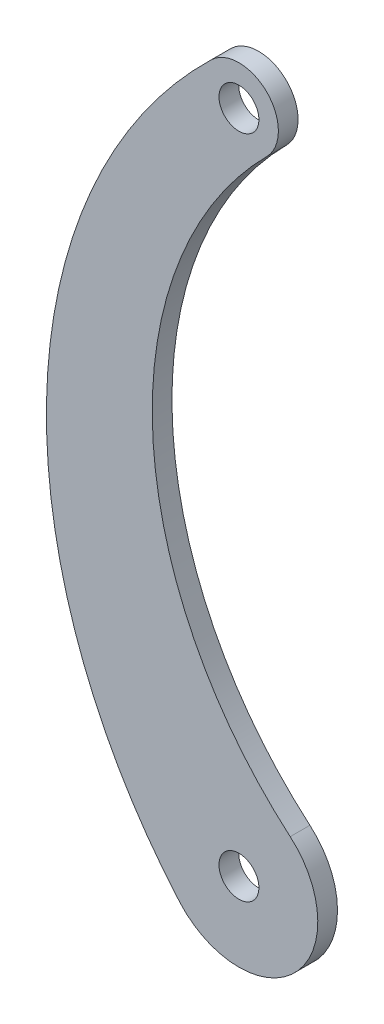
ISO-10303-21;
HEADER;
FILE_DESCRIPTION(('STEP AP214'),'2;1');
FILE_NAME('part.step','',(''),(''),'','','');
FILE_SCHEMA(('AUTOMOTIVE_DESIGN { 1 0 10303 214 1 1 1 1 }'));
ENDSEC;
DATA;
#1=APPLICATION_CONTEXT('core data for automotive mechanical design processes');
#2=APPLICATION_PROTOCOL_DEFINITION('international standard','automotive_design',2000,#1);
#3=PRODUCT_CONTEXT('',#1,'mechanical');
#4=PRODUCT('Part','Part','',(#3));
#5=PRODUCT_RELATED_PRODUCT_CATEGORY('part','',(#4));
#6=PRODUCT_DEFINITION_FORMATION('','',#4);
#7=PRODUCT_DEFINITION_CONTEXT('part definition',#1,'design');
#8=PRODUCT_DEFINITION('design','',#6,#7);
#9=PRODUCT_DEFINITION_SHAPE('','',#8);
#10=(LENGTH_UNIT() NAMED_UNIT(*) SI_UNIT(.MILLI.,.METRE.));
#11=(NAMED_UNIT(*) PLANE_ANGLE_UNIT() SI_UNIT($,.RADIAN.));
#12=(NAMED_UNIT(*) SI_UNIT($,.STERADIAN.) SOLID_ANGLE_UNIT());
#13=UNCERTAINTY_MEASURE_WITH_UNIT(LENGTH_MEASURE(1.E-05),#10,'distance_accuracy_value','');
#14=(GEOMETRIC_REPRESENTATION_CONTEXT(3) GLOBAL_UNCERTAINTY_ASSIGNED_CONTEXT((#13)) GLOBAL_UNIT_ASSIGNED_CONTEXT((#10,
#11,#12)) REPRESENTATION_CONTEXT('',''));
#15=CARTESIAN_POINT('',(0.,0.,0.));
#16=DIRECTION('',(0.,0.,1.));
#17=DIRECTION('',(1.,0.,0.));
#18=AXIS2_PLACEMENT_3D('',#15,#16,#17);
#19=CARTESIAN_POINT('',(0.,-135.,-4.));
#20=DIRECTION('',(0.,0.,1.));
#21=DIRECTION('',(1.,0.,0.));
#22=AXIS2_PLACEMENT_3D('',#19,#20,#21);
#23=CYLINDRICAL_SURFACE('',#22,16.);
#24=CARTESIAN_POINT('',(0.,-135.,0.));
#25=DIRECTION('',(0.,0.,1.));
#26=DIRECTION('',(1.,0.,0.));
#27=AXIS2_PLACEMENT_3D('',#24,#25,#26);
#28=CIRCLE('',#27,16.);
#29=CARTESIAN_POINT('',(-12.0719425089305,-145.500866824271,0.));
#30=VERTEX_POINT('',#29);
#31=CARTESIAN_POINT('',(10.4003569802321,-122.841358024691,0.));
#32=VERTEX_POINT('',#31);
#33=EDGE_CURVE('E100',#30,#32,#28,.T.);
#34=ORIENTED_EDGE('',*,*,#33,.F.);
#35=DIRECTION('',(0.,0.,1.));
#36=VECTOR('',#35,1.);
#37=CARTESIAN_POINT('',(-12.0719425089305,-145.500866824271,-4.));
#38=LINE('',#37,#36);
#39=CARTESIAN_POINT('',(-12.0719425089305,-145.500866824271,-4.));
#40=VERTEX_POINT('',#39);
#41=EDGE_CURVE('E11',#40,#30,#38,.T.);
#42=ORIENTED_EDGE('',*,*,#41,.F.);
#43=CARTESIAN_POINT('',(0.,-135.,-4.));
#44=DIRECTION('',(0.,0.,1.));
#45=DIRECTION('',(1.,0.,0.));
#46=AXIS2_PLACEMENT_3D('',#43,#44,#45);
#47=CIRCLE('',#46,16.);
#48=CARTESIAN_POINT('',(10.4003569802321,-122.841358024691,-4.));
#49=VERTEX_POINT('',#48);
#50=EDGE_CURVE('E93',#40,#49,#47,.T.);
#51=ORIENTED_EDGE('',*,*,#50,.T.);
#52=DIRECTION('',(0.,0.,1.));
#53=VECTOR('',#52,1.);
#54=CARTESIAN_POINT('',(10.4003569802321,-122.841358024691,-4.));
#55=LINE('',#54,#53);
#56=EDGE_CURVE('E38',#49,#32,#55,.T.);
#57=ORIENTED_EDGE('',*,*,#56,.T.);
#58=EDGE_LOOP('',(#34,#42,#51,#57));
#59=FACE_BOUND('',#58,.T.);
#60=ADVANCED_FACE('F35',(#59),#23,.T.);
#61=CARTESIAN_POINT('',(70.9226622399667,-73.3074074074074,-4.));
#62=DIRECTION('',(0.,0.,1.));
#63=DIRECTION('',(1.,0.,0.));
#64=AXIS2_PLACEMENT_3D('',#61,#62,#63);
#65=CYLINDRICAL_SURFACE('',#64,110.);
#66=CARTESIAN_POINT('',(70.9226622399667,-73.3074074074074,0.));
#67=DIRECTION('',(0.,0.,1.));
#68=DIRECTION('',(1.,0.,0.));
#69=AXIS2_PLACEMENT_3D('',#66,#67,#68);
#70=CIRCLE('',#69,110.);
#71=CARTESIAN_POINT('',(-5.56256174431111,5.74960058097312,0.));
#72=VERTEX_POINT('',#71);
#73=EDGE_CURVE('E95',#72,#30,#70,.T.);
#74=ORIENTED_EDGE('',*,*,#73,.F.);
#75=DIRECTION('',(0.,0.,1.));
#76=VECTOR('',#75,1.);
#77=CARTESIAN_POINT('',(-5.56256174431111,5.74960058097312,-4.));
#78=LINE('',#77,#76);
#79=CARTESIAN_POINT('',(-5.56256174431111,5.74960058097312,-4.));
#80=VERTEX_POINT('',#79);
#81=EDGE_CURVE('E44',#80,#72,#78,.T.);
#82=ORIENTED_EDGE('',*,*,#81,.F.);
#83=CARTESIAN_POINT('',(70.9226622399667,-73.3074074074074,-4.));
#84=DIRECTION('',(0.,0.,1.));
#85=DIRECTION('',(1.,0.,0.));
#86=AXIS2_PLACEMENT_3D('',#83,#84,#85);
#87=CIRCLE('',#86,110.);
#88=EDGE_CURVE('E90',#80,#40,#87,.T.);
#89=ORIENTED_EDGE('',*,*,#88,.T.);
#90=ORIENTED_EDGE('',*,*,#41,.T.);
#91=EDGE_LOOP('',(#74,#82,#89,#90));
#92=FACE_BOUND('',#91,.T.);
#93=ADVANCED_FACE('F111',(#92),#65,.T.);
#94=CARTESIAN_POINT('',(0.,0.,-4.));
#95=DIRECTION('',(0.,0.,1.));
#96=DIRECTION('',(1.,0.,0.));
#97=AXIS2_PLACEMENT_3D('',#94,#95,#96);
#98=CYLINDRICAL_SURFACE('',#97,8.);
#99=CARTESIAN_POINT('',(0.,0.,0.));
#100=DIRECTION('',(0.,0.,1.));
#101=DIRECTION('',(1.,0.,0.));
#102=AXIS2_PLACEMENT_3D('',#99,#100,#101);
#103=CIRCLE('',#102,8.);
#104=CARTESIAN_POINT('',(5.6729219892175,-5.64074074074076,0.));
#105=VERTEX_POINT('',#104);
#106=EDGE_CURVE('E85',#105,#72,#103,.T.);
#107=ORIENTED_EDGE('',*,*,#106,.F.);
#108=DIRECTION('',(0.,0.,1.));
#109=VECTOR('',#108,1.);
#110=CARTESIAN_POINT('',(5.6729219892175,-5.64074074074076,-4.));
#111=LINE('',#110,#109);
#112=CARTESIAN_POINT('',(5.6729219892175,-5.64074074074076,-4.));
#113=VERTEX_POINT('',#112);
#114=EDGE_CURVE('E80',#113,#105,#111,.T.);
#115=ORIENTED_EDGE('',*,*,#114,.F.);
#116=CARTESIAN_POINT('',(0.,0.,-4.));
#117=DIRECTION('',(0.,0.,1.));
#118=DIRECTION('',(1.,0.,0.));
#119=AXIS2_PLACEMENT_3D('',#116,#117,#118);
#120=CIRCLE('',#119,8.);
#121=EDGE_CURVE('E83',#113,#80,#120,.T.);
#122=ORIENTED_EDGE('',*,*,#121,.T.);
#123=ORIENTED_EDGE('',*,*,#81,.T.);
#124=EDGE_LOOP('',(#107,#115,#122,#123));
#125=FACE_BOUND('',#124,.T.);
#126=ADVANCED_FACE('F82',(#125),#98,.T.);
#127=CARTESIAN_POINT('',(62.4021418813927,-62.0481481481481,-4.));
#128=DIRECTION('',(0.,0.,1.));
#129=DIRECTION('',(1.,0.,0.));
#130=AXIS2_PLACEMENT_3D('',#127,#128,#129);
#131=CYLINDRICAL_SURFACE('',#130,80.);
#132=CARTESIAN_POINT('',(62.4021418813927,-62.0481481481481,0.));
#133=DIRECTION('',(0.,0.,-1.));
#134=DIRECTION('',(-1.,0.,0.));
#135=AXIS2_PLACEMENT_3D('',#132,#133,#134);
#136=CIRCLE('',#135,80.);
#137=EDGE_CURVE('E103',#32,#105,#136,.T.);
#138=ORIENTED_EDGE('',*,*,#137,.F.);
#139=ORIENTED_EDGE('',*,*,#56,.F.);
#140=CARTESIAN_POINT('',(62.4021418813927,-62.0481481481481,-4.));
#141=DIRECTION('',(0.,0.,-1.));
#142=DIRECTION('',(-1.,0.,0.));
#143=AXIS2_PLACEMENT_3D('',#140,#141,#142);
#144=CIRCLE('',#143,80.);
#145=EDGE_CURVE('E89',#49,#113,#144,.T.);
#146=ORIENTED_EDGE('',*,*,#145,.T.);
#147=ORIENTED_EDGE('',*,*,#114,.T.);
#148=EDGE_LOOP('',(#138,#139,#146,#147));
#149=FACE_BOUND('',#148,.T.);
#150=ADVANCED_FACE('F92',(#149),#131,.F.);
#151=CARTESIAN_POINT('',(31.2010709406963,-98.5240740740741,-4.));
#152=DIRECTION('',(0.,0.,1.));
#153=DIRECTION('',(1.,0.,0.));
#154=AXIS2_PLACEMENT_3D('',#151,#152,#153);
#155=PLANE('',#154);
#156=CARTESIAN_POINT('',(0.,-135.,-4.));
#157=DIRECTION('',(0.,0.,1.));
#158=DIRECTION('',(-1.,0.,0.));
#159=AXIS2_PLACEMENT_3D('',#156,#157,#158);
#160=CIRCLE('',#159,4.05);
#161=CARTESIAN_POINT('',(-4.04999999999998,-135.,-4.));
#162=VERTEX_POINT('',#161);
#163=EDGE_CURVE('E144',#162,#162,#160,.T.);
#164=ORIENTED_EDGE('',*,*,#163,.T.);
#165=EDGE_LOOP('',(#164));
#166=FACE_BOUND('',#165,.T.);
#167=CARTESIAN_POINT('',(0.,0.,-4.));
#168=DIRECTION('',(0.,0.,1.));
#169=DIRECTION('',(-1.,0.,0.));
#170=AXIS2_PLACEMENT_3D('',#167,#168,#169);
#171=CIRCLE('',#170,4.05);
#172=CARTESIAN_POINT('',(-4.05,0.,-4.));
#173=VERTEX_POINT('',#172);
#174=EDGE_CURVE('E104',#173,#173,#171,.T.);
#175=ORIENTED_EDGE('',*,*,#174,.T.);
#176=EDGE_LOOP('',(#175));
#177=FACE_BOUND('',#176,.T.);
#178=ORIENTED_EDGE('',*,*,#50,.F.);
#179=ORIENTED_EDGE('',*,*,#88,.F.);
#180=ORIENTED_EDGE('',*,*,#121,.F.);
#181=ORIENTED_EDGE('',*,*,#145,.F.);
#182=EDGE_LOOP('',(#178,#179,#180,#181));
#183=FACE_BOUND('',#182,.T.);
#184=ADVANCED_FACE('F88',(#166,#177,#183),#155,.F.);
#185=CARTESIAN_POINT('',(31.2010709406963,-98.5240740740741,0.));
#186=DIRECTION('',(0.,0.,1.));
#187=DIRECTION('',(1.,0.,0.));
#188=AXIS2_PLACEMENT_3D('',#185,#186,#187);
#189=PLANE('',#188);
#190=CARTESIAN_POINT('',(0.,-135.,0.));
#191=DIRECTION('',(0.,0.,1.));
#192=DIRECTION('',(-1.,0.,0.));
#193=AXIS2_PLACEMENT_3D('',#190,#191,#192);
#194=CIRCLE('',#193,4.05);
#195=CARTESIAN_POINT('',(-4.04999999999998,-135.,0.));
#196=VERTEX_POINT('',#195);
#197=EDGE_CURVE('E147',#196,#196,#194,.T.);
#198=ORIENTED_EDGE('',*,*,#197,.F.);
#199=EDGE_LOOP('',(#198));
#200=FACE_BOUND('',#199,.T.);
#201=CARTESIAN_POINT('',(0.,0.,0.));
#202=DIRECTION('',(0.,0.,1.));
#203=DIRECTION('',(-1.,0.,0.));
#204=AXIS2_PLACEMENT_3D('',#201,#202,#203);
#205=CIRCLE('',#204,4.05);
#206=CARTESIAN_POINT('',(-4.05,0.,0.));
#207=VERTEX_POINT('',#206);
#208=EDGE_CURVE('E149',#207,#207,#205,.T.);
#209=ORIENTED_EDGE('',*,*,#208,.F.);
#210=EDGE_LOOP('',(#209));
#211=FACE_BOUND('',#210,.T.);
#212=ORIENTED_EDGE('',*,*,#33,.T.);
#213=ORIENTED_EDGE('',*,*,#137,.T.);
#214=ORIENTED_EDGE('',*,*,#106,.T.);
#215=ORIENTED_EDGE('',*,*,#73,.T.);
#216=EDGE_LOOP('',(#212,#213,#214,#215));
#217=FACE_BOUND('',#216,.T.);
#218=ADVANCED_FACE('F110',(#200,#211,#217),#189,.T.);
#219=CARTESIAN_POINT('',(0.,0.,-4.));
#220=DIRECTION('',(0.,0.,1.));
#221=DIRECTION('',(1.,0.,0.));
#222=AXIS2_PLACEMENT_3D('',#219,#220,#221);
#223=CYLINDRICAL_SURFACE('',#222,4.05);
#224=ORIENTED_EDGE('',*,*,#174,.F.);
#225=EDGE_LOOP('',(#224));
#226=FACE_BOUND('',#225,.T.);
#227=ORIENTED_EDGE('',*,*,#208,.T.);
#228=EDGE_LOOP('',(#227));
#229=FACE_BOUND('',#228,.T.);
#230=ADVANCED_FACE('F129',(#226,#229),#223,.F.);
#231=CARTESIAN_POINT('',(0.,-135.,-4.));
#232=DIRECTION('',(0.,0.,1.));
#233=DIRECTION('',(1.,0.,0.));
#234=AXIS2_PLACEMENT_3D('',#231,#232,#233);
#235=CYLINDRICAL_SURFACE('',#234,4.05);
#236=ORIENTED_EDGE('',*,*,#163,.F.);
#237=EDGE_LOOP('',(#236));
#238=FACE_BOUND('',#237,.T.);
#239=ORIENTED_EDGE('',*,*,#197,.T.);
#240=EDGE_LOOP('',(#239));
#241=FACE_BOUND('',#240,.T.);
#242=ADVANCED_FACE('F136',(#238,#241),#235,.F.);
#243=CLOSED_SHELL('',(#60,#93,#126,#150,#184,#218,#230,#242));
#244=MANIFOLD_SOLID_BREP('B2',#243);
#245=ADVANCED_BREP_SHAPE_REPRESENTATION('',(#18,#244),#14);
#246=SHAPE_DEFINITION_REPRESENTATION(#9,#245);
ENDSEC;
END-ISO-10303-21;
